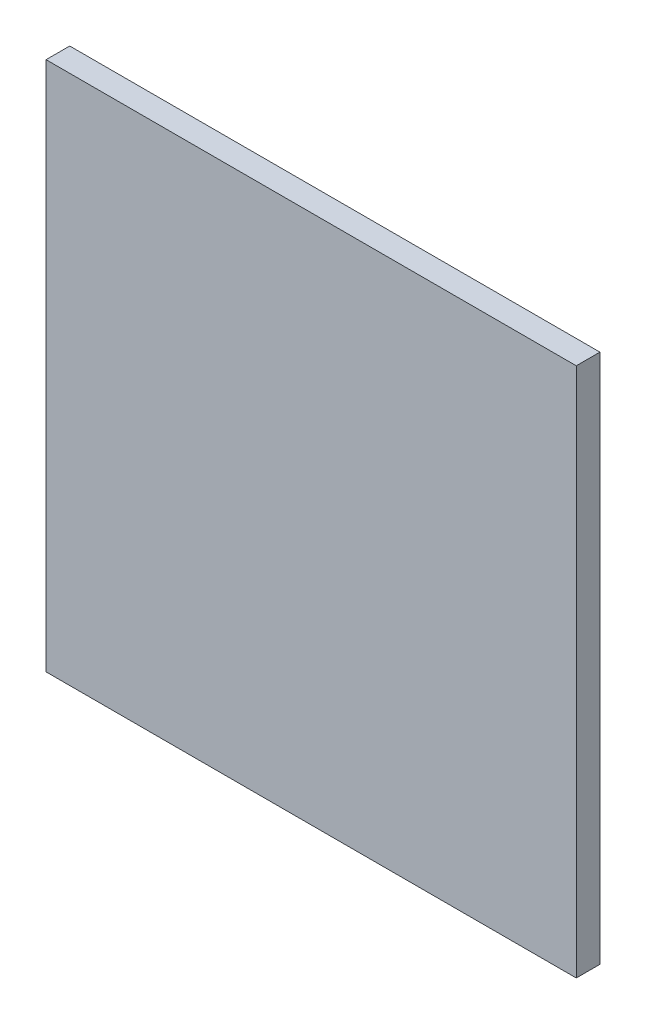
ISO-10303-21;
HEADER;
FILE_DESCRIPTION(('STEP AP214'),'2;1');
FILE_NAME('part.step','',(''),(''),'','','');
FILE_SCHEMA(('AUTOMOTIVE_DESIGN { 1 0 10303 214 1 1 1 1 }'));
ENDSEC;
DATA;
#1=APPLICATION_CONTEXT('core data for automotive mechanical design processes');
#2=APPLICATION_PROTOCOL_DEFINITION('international standard','automotive_design',2000,#1);
#3=PRODUCT_CONTEXT('',#1,'mechanical');
#4=PRODUCT('Part','Part','',(#3));
#5=PRODUCT_RELATED_PRODUCT_CATEGORY('part','',(#4));
#6=PRODUCT_DEFINITION_FORMATION('','',#4);
#7=PRODUCT_DEFINITION_CONTEXT('part definition',#1,'design');
#8=PRODUCT_DEFINITION('design','',#6,#7);
#9=PRODUCT_DEFINITION_SHAPE('','',#8);
#10=(LENGTH_UNIT() NAMED_UNIT(*) SI_UNIT(.MILLI.,.METRE.));
#11=(NAMED_UNIT(*) PLANE_ANGLE_UNIT() SI_UNIT($,.RADIAN.));
#12=(NAMED_UNIT(*) SI_UNIT($,.STERADIAN.) SOLID_ANGLE_UNIT());
#13=UNCERTAINTY_MEASURE_WITH_UNIT(LENGTH_MEASURE(1.E-05),#10,'distance_accuracy_value','');
#14=(GEOMETRIC_REPRESENTATION_CONTEXT(3) GLOBAL_UNCERTAINTY_ASSIGNED_CONTEXT((#13)) GLOBAL_UNIT_ASSIGNED_CONTEXT((#10,
#11,#12)) REPRESENTATION_CONTEXT('',''));
#15=CARTESIAN_POINT('',(0.,0.,0.));
#16=DIRECTION('',(0.,0.,1.));
#17=DIRECTION('',(1.,0.,0.));
#18=AXIS2_PLACEMENT_3D('',#15,#16,#17);
#19=CARTESIAN_POINT('',(-35.56,-35.56,3.175));
#20=DIRECTION('',(1.,0.,0.));
#21=DIRECTION('',(0.,0.,-1.));
#22=AXIS2_PLACEMENT_3D('',#19,#20,#21);
#23=PLANE('',#22);
#24=DIRECTION('',(0.,-1.,0.));
#25=VECTOR('',#24,1.);
#26=CARTESIAN_POINT('',(-35.56,-35.56,0.));
#27=LINE('',#26,#25);
#28=CARTESIAN_POINT('',(-35.56,35.56,0.));
#29=VERTEX_POINT('',#28);
#30=CARTESIAN_POINT('',(-35.56,-35.56,0.));
#31=VERTEX_POINT('',#30);
#32=EDGE_CURVE('E96',#29,#31,#27,.T.);
#33=ORIENTED_EDGE('',*,*,#32,.T.);
#34=DIRECTION('',(0.,0.,-1.));
#35=VECTOR('',#34,1.);
#36=CARTESIAN_POINT('',(-35.56,-35.56,3.175));
#37=LINE('',#36,#35);
#38=CARTESIAN_POINT('',(-35.56,-35.56,3.175));
#39=VERTEX_POINT('',#38);
#40=EDGE_CURVE('E11',#39,#31,#37,.T.);
#41=ORIENTED_EDGE('',*,*,#40,.F.);
#42=DIRECTION('',(0.,-1.,0.));
#43=VECTOR('',#42,1.);
#44=CARTESIAN_POINT('',(-35.56,-35.56,3.175));
#45=LINE('',#44,#43);
#46=CARTESIAN_POINT('',(-35.56,35.56,3.175));
#47=VERTEX_POINT('',#46);
#48=EDGE_CURVE('E84',#47,#39,#45,.T.);
#49=ORIENTED_EDGE('',*,*,#48,.F.);
#50=DIRECTION('',(0.,0.,-1.));
#51=VECTOR('',#50,1.);
#52=CARTESIAN_POINT('',(-35.56,35.56,3.175));
#53=LINE('',#52,#51);
#54=EDGE_CURVE('E92',#47,#29,#53,.T.);
#55=ORIENTED_EDGE('',*,*,#54,.T.);
#56=EDGE_LOOP('',(#33,#41,#49,#55));
#57=FACE_BOUND('',#56,.T.);
#58=ADVANCED_FACE('F33',(#57),#23,.F.);
#59=CARTESIAN_POINT('',(35.56,-35.56,3.175));
#60=DIRECTION('',(0.,1.,0.));
#61=DIRECTION('',(-1.,0.,0.));
#62=AXIS2_PLACEMENT_3D('',#59,#60,#61);
#63=PLANE('',#62);
#64=DIRECTION('',(1.,0.,0.));
#65=VECTOR('',#64,1.);
#66=CARTESIAN_POINT('',(35.56,-35.56,0.));
#67=LINE('',#66,#65);
#68=CARTESIAN_POINT('',(35.56,-35.56,0.));
#69=VERTEX_POINT('',#68);
#70=EDGE_CURVE('E88',#31,#69,#67,.T.);
#71=ORIENTED_EDGE('',*,*,#70,.T.);
#72=DIRECTION('',(0.,0.,-1.));
#73=VECTOR('',#72,1.);
#74=CARTESIAN_POINT('',(35.56,-35.56,3.175));
#75=LINE('',#74,#73);
#76=CARTESIAN_POINT('',(35.56,-35.56,3.175));
#77=VERTEX_POINT('',#76);
#78=EDGE_CURVE('E41',#77,#69,#75,.T.);
#79=ORIENTED_EDGE('',*,*,#78,.F.);
#80=DIRECTION('',(1.,0.,0.));
#81=VECTOR('',#80,1.);
#82=CARTESIAN_POINT('',(35.56,-35.56,3.175));
#83=LINE('',#82,#81);
#84=EDGE_CURVE('E79',#39,#77,#83,.T.);
#85=ORIENTED_EDGE('',*,*,#84,.F.);
#86=ORIENTED_EDGE('',*,*,#40,.T.);
#87=EDGE_LOOP('',(#71,#79,#85,#86));
#88=FACE_BOUND('',#87,.T.);
#89=ADVANCED_FACE('F87',(#88),#63,.F.);
#90=CARTESIAN_POINT('',(35.56,-35.56,3.175));
#91=DIRECTION('',(-1.,0.,0.));
#92=DIRECTION('',(0.,-1.,0.));
#93=AXIS2_PLACEMENT_3D('',#90,#91,#92);
#94=PLANE('',#93);
#95=DIRECTION('',(0.,1.,0.));
#96=VECTOR('',#95,1.);
#97=CARTESIAN_POINT('',(35.56,-35.56,0.));
#98=LINE('',#97,#96);
#99=CARTESIAN_POINT('',(35.56,35.56,0.));
#100=VERTEX_POINT('',#99);
#101=EDGE_CURVE('E66',#69,#100,#98,.T.);
#102=ORIENTED_EDGE('',*,*,#101,.T.);
#103=DIRECTION('',(0.,0.,-1.));
#104=VECTOR('',#103,1.);
#105=CARTESIAN_POINT('',(35.56,35.56,3.175));
#106=LINE('',#105,#104);
#107=CARTESIAN_POINT('',(35.56,35.56,3.175));
#108=VERTEX_POINT('',#107);
#109=EDGE_CURVE('E89',#108,#100,#106,.T.);
#110=ORIENTED_EDGE('',*,*,#109,.F.);
#111=DIRECTION('',(0.,1.,0.));
#112=VECTOR('',#111,1.);
#113=CARTESIAN_POINT('',(35.56,-35.56,3.175));
#114=LINE('',#113,#112);
#115=EDGE_CURVE('E82',#77,#108,#114,.T.);
#116=ORIENTED_EDGE('',*,*,#115,.F.);
#117=ORIENTED_EDGE('',*,*,#78,.T.);
#118=EDGE_LOOP('',(#102,#110,#116,#117));
#119=FACE_BOUND('',#118,.T.);
#120=ADVANCED_FACE('F90',(#119),#94,.F.);
#121=CARTESIAN_POINT('',(35.56,35.56,3.175));
#122=DIRECTION('',(0.,-1.,0.));
#123=DIRECTION('',(1.,0.,0.));
#124=AXIS2_PLACEMENT_3D('',#121,#122,#123);
#125=PLANE('',#124);
#126=DIRECTION('',(-1.,0.,0.));
#127=VECTOR('',#126,1.);
#128=CARTESIAN_POINT('',(35.56,35.56,0.));
#129=LINE('',#128,#127);
#130=EDGE_CURVE('E72',#100,#29,#129,.T.);
#131=ORIENTED_EDGE('',*,*,#130,.T.);
#132=ORIENTED_EDGE('',*,*,#54,.F.);
#133=DIRECTION('',(-1.,0.,0.));
#134=VECTOR('',#133,1.);
#135=CARTESIAN_POINT('',(35.56,35.56,3.175));
#136=LINE('',#135,#134);
#137=EDGE_CURVE('E49',#108,#47,#136,.T.);
#138=ORIENTED_EDGE('',*,*,#137,.F.);
#139=ORIENTED_EDGE('',*,*,#109,.T.);
#140=EDGE_LOOP('',(#131,#132,#138,#139));
#141=FACE_BOUND('',#140,.T.);
#142=ADVANCED_FACE('F103',(#141),#125,.F.);
#143=CARTESIAN_POINT('',(0.,0.,3.175));
#144=DIRECTION('',(0.,0.,1.));
#145=DIRECTION('',(1.,0.,0.));
#146=AXIS2_PLACEMENT_3D('',#143,#144,#145);
#147=PLANE('',#146);
#148=ORIENTED_EDGE('',*,*,#48,.T.);
#149=ORIENTED_EDGE('',*,*,#84,.T.);
#150=ORIENTED_EDGE('',*,*,#115,.T.);
#151=ORIENTED_EDGE('',*,*,#137,.T.);
#152=EDGE_LOOP('',(#148,#149,#150,#151));
#153=FACE_BOUND('',#152,.T.);
#154=ADVANCED_FACE('F80',(#153),#147,.T.);
#155=CARTESIAN_POINT('',(0.,0.,0.));
#156=DIRECTION('',(0.,0.,1.));
#157=DIRECTION('',(1.,0.,0.));
#158=AXIS2_PLACEMENT_3D('',#155,#156,#157);
#159=PLANE('',#158);
#160=ORIENTED_EDGE('',*,*,#32,.F.);
#161=ORIENTED_EDGE('',*,*,#130,.F.);
#162=ORIENTED_EDGE('',*,*,#101,.F.);
#163=ORIENTED_EDGE('',*,*,#70,.F.);
#164=EDGE_LOOP('',(#160,#161,#162,#163));
#165=FACE_BOUND('',#164,.T.);
#166=ADVANCED_FACE('F106',(#165),#159,.F.);
#167=CLOSED_SHELL('',(#58,#89,#120,#142,#154,#166));
#168=MANIFOLD_SOLID_BREP('B2',#167);
#169=ADVANCED_BREP_SHAPE_REPRESENTATION('',(#18,#168),#14);
#170=SHAPE_DEFINITION_REPRESENTATION(#9,#169);
ENDSEC;
END-ISO-10303-21;
